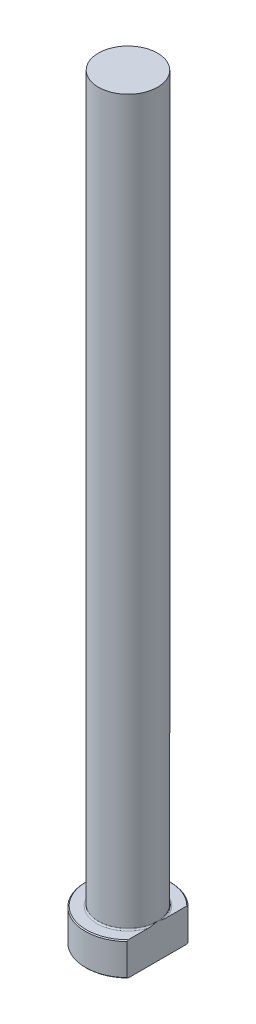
ISO-10303-21;
HEADER;
FILE_DESCRIPTION(('STEP AP214'),'2;1');
FILE_NAME('part.step','',(''),(''),'','','');
FILE_SCHEMA(('AUTOMOTIVE_DESIGN { 1 0 10303 214 1 1 1 1 }'));
ENDSEC;
DATA;
#1=APPLICATION_CONTEXT('core data for automotive mechanical design processes');
#2=APPLICATION_PROTOCOL_DEFINITION('international standard','automotive_design',2000,#1);
#3=PRODUCT_CONTEXT('',#1,'mechanical');
#4=PRODUCT('Part','Part','',(#3));
#5=PRODUCT_RELATED_PRODUCT_CATEGORY('part','',(#4));
#6=PRODUCT_DEFINITION_FORMATION('','',#4);
#7=PRODUCT_DEFINITION_CONTEXT('part definition',#1,'design');
#8=PRODUCT_DEFINITION('design','',#6,#7);
#9=PRODUCT_DEFINITION_SHAPE('','',#8);
#10=(LENGTH_UNIT() NAMED_UNIT(*) SI_UNIT(.MILLI.,.METRE.));
#11=(NAMED_UNIT(*) PLANE_ANGLE_UNIT() SI_UNIT($,.RADIAN.));
#12=(NAMED_UNIT(*) SI_UNIT($,.STERADIAN.) SOLID_ANGLE_UNIT());
#13=UNCERTAINTY_MEASURE_WITH_UNIT(LENGTH_MEASURE(1.E-05),#10,'distance_accuracy_value','');
#14=(GEOMETRIC_REPRESENTATION_CONTEXT(3) GLOBAL_UNCERTAINTY_ASSIGNED_CONTEXT((#13)) GLOBAL_UNIT_ASSIGNED_CONTEXT((#10,
#11,#12)) REPRESENTATION_CONTEXT('',''));
#15=CARTESIAN_POINT('',(0.,0.,0.));
#16=DIRECTION('',(0.,0.,1.));
#17=DIRECTION('',(1.,0.,0.));
#18=AXIS2_PLACEMENT_3D('',#15,#16,#17);
#19=CARTESIAN_POINT('',(0.,0.,0.));
#20=DIRECTION('',(0.,-1.,0.));
#21=DIRECTION('',(0.,0.,-1.));
#22=AXIS2_PLACEMENT_3D('',#19,#20,#21);
#23=PLANE('',#22);
#24=CARTESIAN_POINT('',(0.,0.,0.));
#25=DIRECTION('',(0.,-1.,0.));
#26=DIRECTION('',(0.,0.,-1.));
#27=AXIS2_PLACEMENT_3D('',#24,#25,#26);
#28=CIRCLE('',#27,8.79999999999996);
#29=CARTESIAN_POINT('',(6.24999999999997,0.,6.1949576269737));
#30=VERTEX_POINT('',#29);
#31=CARTESIAN_POINT('',(6.24999999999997,0.,-6.1949576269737));
#32=VERTEX_POINT('',#31);
#33=EDGE_CURVE('E98',#30,#32,#28,.T.);
#34=ORIENTED_EDGE('',*,*,#33,.T.);
#35=DIRECTION('',(0.,0.,1.));
#36=VECTOR('',#35,1.);
#37=CARTESIAN_POINT('',(6.24999999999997,0.,-6.47591692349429));
#38=LINE('',#37,#36);
#39=EDGE_CURVE('E83',#32,#30,#38,.T.);
#40=ORIENTED_EDGE('',*,*,#39,.T.);
#41=EDGE_LOOP('',(#34,#40));
#42=FACE_BOUND('',#41,.T.);
#43=ADVANCED_FACE('F32',(#42),#23,.T.);
#44=CARTESIAN_POINT('',(0.,259.958771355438,0.));
#45=DIRECTION('',(0.,1.,0.));
#46=DIRECTION('',(0.,0.,1.));
#47=AXIS2_PLACEMENT_3D('',#44,#45,#46);
#48=CYLINDRICAL_SURFACE('',#47,8.99999999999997);
#49=CARTESIAN_POINT('',(0.,6.80000000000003,0.));
#50=DIRECTION('',(0.,1.,0.));
#51=DIRECTION('',(0.,0.,1.));
#52=AXIS2_PLACEMENT_3D('',#49,#50,#51);
#53=CIRCLE('',#52,8.99999999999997);
#54=CARTESIAN_POINT('',(6.24999999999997,6.80000000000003,6.47591692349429));
#55=VERTEX_POINT('',#54);
#56=CARTESIAN_POINT('',(6.24999999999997,6.80000000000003,-6.47591692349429));
#57=VERTEX_POINT('',#56);
#58=EDGE_CURVE('E104',#55,#57,#53,.F.);
#59=ORIENTED_EDGE('',*,*,#58,.T.);
#60=DIRECTION('',(0.,-1.,0.));
#61=VECTOR('',#60,1.);
#62=CARTESIAN_POINT('',(6.24999999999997,160.,-6.47591692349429));
#63=LINE('',#62,#61);
#64=CARTESIAN_POINT('',(6.24999999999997,0.199999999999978,-6.47591692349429));
#65=VERTEX_POINT('',#64);
#66=EDGE_CURVE('E183',#57,#65,#63,.T.);
#67=ORIENTED_EDGE('',*,*,#66,.T.);
#68=CARTESIAN_POINT('',(0.,0.199999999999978,0.));
#69=DIRECTION('',(0.,-1.,0.));
#70=DIRECTION('',(0.,0.,-1.));
#71=AXIS2_PLACEMENT_3D('',#68,#69,#70);
#72=CIRCLE('',#71,8.99999999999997);
#73=CARTESIAN_POINT('',(6.24999999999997,0.199999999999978,6.47591692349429));
#74=VERTEX_POINT('',#73);
#75=EDGE_CURVE('E100',#65,#74,#72,.F.);
#76=ORIENTED_EDGE('',*,*,#75,.T.);
#77=DIRECTION('',(0.,-1.,0.));
#78=VECTOR('',#77,1.);
#79=CARTESIAN_POINT('',(6.24999999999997,160.,6.47591692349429));
#80=LINE('',#79,#78);
#81=EDGE_CURVE('E93',#55,#74,#80,.T.);
#82=ORIENTED_EDGE('',*,*,#81,.F.);
#83=EDGE_LOOP('',(#59,#67,#76,#82));
#84=FACE_BOUND('',#83,.T.);
#85=ADVANCED_FACE('F158',(#84),#48,.T.);
#86=CARTESIAN_POINT('',(-8.99999999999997,7.,0.));
#87=DIRECTION('',(0.,1.,0.));
#88=DIRECTION('',(0.,0.,1.));
#89=AXIS2_PLACEMENT_3D('',#86,#87,#88);
#90=PLANE('',#89);
#91=CARTESIAN_POINT('',(0.,7.,0.));
#92=DIRECTION('',(0.,1.,0.));
#93=DIRECTION('',(0.,0.,1.));
#94=AXIS2_PLACEMENT_3D('',#91,#92,#93);
#95=CIRCLE('',#94,8.79999999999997);
#96=CARTESIAN_POINT('',(6.24999999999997,7.,-6.19495762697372));
#97=VERTEX_POINT('',#96);
#98=CARTESIAN_POINT('',(6.24999999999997,7.,6.19495762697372));
#99=VERTEX_POINT('',#98);
#100=EDGE_CURVE('E178',#97,#99,#95,.T.);
#101=ORIENTED_EDGE('',*,*,#100,.T.);
#102=DIRECTION('',(0.,0.,-1.));
#103=VECTOR('',#102,1.);
#104=CARTESIAN_POINT('',(6.24999999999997,7.,0.));
#105=LINE('',#104,#103);
#106=CARTESIAN_POINT('',(6.24999999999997,6.99999999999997,1.95959179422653));
#107=VERTEX_POINT('',#106);
#108=EDGE_CURVE('E57',#99,#107,#105,.T.);
#109=ORIENTED_EDGE('',*,*,#108,.T.);
#110=CARTESIAN_POINT('',(0.,7.,0.));
#111=DIRECTION('',(0.,1.,0.));
#112=DIRECTION('',(0.,0.,1.));
#113=AXIS2_PLACEMENT_3D('',#110,#111,#112);
#114=CIRCLE('',#113,6.54999999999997);
#115=CARTESIAN_POINT('',(6.24999999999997,6.99999999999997,-1.95959179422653));
#116=VERTEX_POINT('',#115);
#117=EDGE_CURVE('E107',#107,#116,#114,.F.);
#118=ORIENTED_EDGE('',*,*,#117,.T.);
#119=EDGE_CURVE('E136',#116,#97,#105,.T.);
#120=ORIENTED_EDGE('',*,*,#119,.T.);
#121=EDGE_LOOP('',(#101,#109,#118,#120));
#122=FACE_BOUND('',#121,.T.);
#123=ADVANCED_FACE('F147',(#122),#90,.T.);
#124=CARTESIAN_POINT('',(0.,7.00000000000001,0.));
#125=DIRECTION('',(0.,-1.,0.));
#126=DIRECTION('',(0.,0.,-1.));
#127=AXIS2_PLACEMENT_3D('',#124,#125,#126);
#128=CONICAL_SURFACE('',#127,8.79999999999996,0.785398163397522);
#129=ORIENTED_EDGE('',*,*,#58,.F.);
#130=CARTESIAN_POINT('',(6.24999999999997,0.241333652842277,14.2481436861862));
#131=CARTESIAN_POINT('',(6.24999999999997,0.433510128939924,14.0382871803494));
#132=CARTESIAN_POINT('',(6.24999999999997,0.625318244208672,13.8280934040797));
#133=CARTESIAN_POINT('',(6.24999999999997,1.00808847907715,13.406933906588));
#134=CARTESIAN_POINT('',(6.24999999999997,1.1990505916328,13.195968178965));
#135=CARTESIAN_POINT('',(6.24999999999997,1.77058893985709,12.5616726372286));
#136=CARTESIAN_POINT('',(6.24999999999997,2.14972657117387,12.1370432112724));
#137=CARTESIAN_POINT('',(6.24999999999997,2.90544742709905,11.2804244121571));
#138=CARTESIAN_POINT('',(6.24999999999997,3.28199640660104,10.8484047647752));
#139=CARTESIAN_POINT('',(6.24999999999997,4.0280031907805,9.97835973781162));
#140=CARTESIAN_POINT('',(6.24999999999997,4.3974618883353,9.54033512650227));
#141=CARTESIAN_POINT('',(6.24999999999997,5.06619556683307,8.72902037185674));
#142=CARTESIAN_POINT('',(6.24999999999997,5.36698522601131,8.35698524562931));
#143=CARTESIAN_POINT('',(6.24999999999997,5.81091107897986,7.79312105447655));
#144=CARTESIAN_POINT('',(6.24999999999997,5.95769918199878,7.60416746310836));
#145=CARTESIAN_POINT('',(6.24999999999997,6.2483499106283,7.22402635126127));
#146=CARTESIAN_POINT('',(6.24999999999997,6.39221261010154,7.03283888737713));
#147=CARTESIAN_POINT('',(6.24999999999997,6.67624882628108,6.64809388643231));
#148=CARTESIAN_POINT('',(6.24999999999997,6.81642658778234,6.45453948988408));
#149=CARTESIAN_POINT('',(6.24999999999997,7.09250069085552,6.06440831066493));
#150=CARTESIAN_POINT('',(6.24999999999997,7.22839726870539,5.86783169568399));
#151=CARTESIAN_POINT('',(6.24999999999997,7.4948722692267,5.47121725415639));
#152=CARTESIAN_POINT('',(6.24999999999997,7.62545297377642,5.27118096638));
#153=CARTESIAN_POINT('',(6.24999999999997,7.88005759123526,4.86699392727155));
#154=CARTESIAN_POINT('',(6.24999999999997,8.00408234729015,4.66284370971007));
#155=CARTESIAN_POINT('',(6.24999999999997,8.24192682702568,4.25315549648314));
#156=CARTESIAN_POINT('',(6.24999999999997,8.35588135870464,4.04769623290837));
#157=CARTESIAN_POINT('',(6.24999999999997,8.57376120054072,3.63145654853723));
#158=CARTESIAN_POINT('',(6.24999999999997,8.67768550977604,3.42067559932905));
#159=CARTESIAN_POINT('',(6.24999999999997,8.87268822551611,2.99352725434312));
#160=CARTESIAN_POINT('',(6.24999999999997,8.96378316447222,2.77716748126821));
#161=CARTESIAN_POINT('',(6.24999999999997,9.12997532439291,2.33835397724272));
#162=CARTESIAN_POINT('',(6.24999999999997,9.20507709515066,2.11590199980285));
#163=CARTESIAN_POINT('',(6.24999999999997,9.32245998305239,1.71047588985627));
#164=CARTESIAN_POINT('',(6.24999999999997,9.36830307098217,1.52853906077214));
#165=CARTESIAN_POINT('',(6.24999999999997,9.44550018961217,1.16159607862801));
#166=CARTESIAN_POINT('',(6.24999999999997,9.47685624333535,0.976590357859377));
#167=CARTESIAN_POINT('',(6.24999999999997,9.52348341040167,0.605004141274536));
#168=CARTESIAN_POINT('',(6.24999999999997,9.53879458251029,0.418428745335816));
#169=CARTESIAN_POINT('',(6.24999999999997,9.55263073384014,0.044648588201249));
#170=CARTESIAN_POINT('',(6.24999999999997,9.5511559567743,-0.142556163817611));
#171=CARTESIAN_POINT('',(6.24999999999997,9.53151010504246,-0.515964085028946));
#172=CARTESIAN_POINT('',(6.24999999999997,9.51334871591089,-0.702167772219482));
#173=CARTESIAN_POINT('',(6.24999999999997,9.46132296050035,-1.07235055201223));
#174=CARTESIAN_POINT('',(6.24999999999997,9.42745724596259,-1.25632945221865));
#175=CARTESIAN_POINT('',(6.24999999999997,9.34551825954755,-1.62161387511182));
#176=CARTESIAN_POINT('',(6.24999999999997,9.29740414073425,-1.80291011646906));
#177=CARTESIAN_POINT('',(6.24999999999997,9.18891949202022,-2.1617472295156));
#178=CARTESIAN_POINT('',(6.24999999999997,9.12854919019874,-2.33928817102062));
#179=CARTESIAN_POINT('',(6.24999999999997,8.98038960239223,-2.736196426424));
#180=CARTESIAN_POINT('',(6.24999999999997,8.8895537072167,-2.95442044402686));
#181=CARTESIAN_POINT('',(6.24999999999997,8.69480317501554,-3.38500003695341));
#182=CARTESIAN_POINT('',(6.24999999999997,8.59088203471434,-3.59735262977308));
#183=CARTESIAN_POINT('',(6.24999999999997,8.37253952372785,-4.01706977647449));
#184=CARTESIAN_POINT('',(6.24999999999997,8.2580982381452,-4.22442389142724));
#185=CARTESIAN_POINT('',(6.24999999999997,8.02107167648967,-4.63434772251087));
#186=CARTESIAN_POINT('',(6.24999999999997,7.89848770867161,-4.83691820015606));
#187=CARTESIAN_POINT('',(6.24999999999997,7.64548625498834,-5.2400840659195));
#188=CARTESIAN_POINT('',(6.24999999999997,7.51499955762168,-5.44063581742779));
#189=CARTESIAN_POINT('',(6.24999999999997,7.24868510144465,-5.83817237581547));
#190=CARTESIAN_POINT('',(6.24999999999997,7.11285688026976,-6.03515687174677));
#191=CARTESIAN_POINT('',(6.24999999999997,6.83683288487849,-6.42612120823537));
#192=CARTESIAN_POINT('',(6.24999999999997,6.69663581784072,-6.62010013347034));
#193=CARTESIAN_POINT('',(6.24999999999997,6.41268260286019,-7.00543858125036));
#194=CARTESIAN_POINT('',(6.24999999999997,6.26892633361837,-7.19679801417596));
#195=CARTESIAN_POINT('',(6.24999999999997,5.89056224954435,-7.69242940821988));
#196=CARTESIAN_POINT('',(6.24999999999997,5.65363599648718,-7.99493062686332));
#197=CARTESIAN_POINT('',(6.24999999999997,5.17412949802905,-8.59529922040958));
#198=CARTESIAN_POINT('',(6.24999999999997,4.93155037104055,-8.89316749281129));
#199=CARTESIAN_POINT('',(6.24999999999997,4.44181409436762,-9.48544309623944));
#200=CARTESIAN_POINT('',(6.24999999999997,4.19465400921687,-9.77984799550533));
#201=CARTESIAN_POINT('',(6.24999999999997,3.69683790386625,-10.3657062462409));
#202=CARTESIAN_POINT('',(6.24999999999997,3.44618171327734,-10.6571594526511));
#203=CARTESIAN_POINT('',(6.24999999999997,2.95199448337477,-11.2262122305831));
#204=CARTESIAN_POINT('',(6.24999999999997,2.70857128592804,-11.5039055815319));
#205=CARTESIAN_POINT('',(6.24999999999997,2.21961081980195,-12.0574158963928));
#206=CARTESIAN_POINT('',(6.24999999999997,1.97407358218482,-12.3332328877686));
#207=CARTESIAN_POINT('',(6.24999999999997,1.48150971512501,-12.8829958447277));
#208=CARTESIAN_POINT('',(6.24999999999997,1.23448497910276,-13.1569435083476));
#209=CARTESIAN_POINT('',(6.24999999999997,0.738953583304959,-13.703494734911));
#210=CARTESIAN_POINT('',(6.24999999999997,0.490446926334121,-13.9760983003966));
#211=CARTESIAN_POINT('',(6.24999999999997,0.241333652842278,-14.2481436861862));
#212=B_SPLINE_CURVE_WITH_KNOTS('',3,(#130,#131,#132,#133,#134,#135,#136,#137,#138,#139,#140,
#141,#142,#143,#144,#145,#146,#147,#148,#149,#150,#151,#152,#153,#154,#155,#156,#157,#158,#159,
#160,#161,#162,#163,#164,#165,#166,#167,#168,#169,#170,#171,#172,#173,#174,#175,#176,#177,#178,
#179,#180,#181,#182,#183,#184,#185,#186,#187,#188,#189,#190,#191,#192,#193,#194,#195,#196,#197,
#198,#199,#200,#201,#202,#203,#204,#205,#206,#207,#208,#209,#210,#211),.UNSPECIFIED.,.F.,.F.,(4,
2,2,2,2,2,2,2,2,2,2,2,2,2,2,2,2,2,2,2,2,2,2,2,2,2,2,2,2,2,2,2,2,2,2,2,2,2,2,2,4),(0.,
0.853664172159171,1.70733543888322,3.41508002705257,5.13429133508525,6.85328470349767,
8.28840776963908,9.00619588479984,9.72396585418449,10.4408691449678,11.1577328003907,
11.8742854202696,12.5907456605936,13.2953619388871,14.0000484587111,14.7038184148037,
15.4073878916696,15.9697505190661,16.5320345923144,17.0929114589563,17.6537801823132,
18.2143235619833,18.7749150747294,19.3371294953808,19.8993334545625,20.6078926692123,
21.3168054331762,22.027088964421,22.7372586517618,23.4549493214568,24.1727022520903,
24.8906696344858,25.6086615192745,26.7612833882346,27.9136791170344,29.0668407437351,
30.2200587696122,31.3278889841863,32.4357029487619,33.5423213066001,34.6489375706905),.UNSPECIFIED.);
#213=EDGE_CURVE('E135',#55,#99,#212,.T.);
#214=ORIENTED_EDGE('',*,*,#213,.T.);
#215=ORIENTED_EDGE('',*,*,#100,.F.);
#216=EDGE_CURVE('E127',#97,#57,#212,.T.);
#217=ORIENTED_EDGE('',*,*,#216,.T.);
#218=EDGE_LOOP('',(#129,#214,#215,#217));
#219=FACE_BOUND('',#218,.T.);
#220=ADVANCED_FACE('F143',(#219),#128,.T.);
#221=CARTESIAN_POINT('',(0.,0.199999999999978,0.));
#222=DIRECTION('',(0.,1.,0.));
#223=DIRECTION('',(0.,0.,1.));
#224=AXIS2_PLACEMENT_3D('',#221,#222,#223);
#225=CONICAL_SURFACE('',#224,8.99999999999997,0.785398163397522);
#226=ORIENTED_EDGE('',*,*,#75,.F.);
#227=CARTESIAN_POINT('',(6.24999999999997,6.75866634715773,-14.2481436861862));
#228=CARTESIAN_POINT('',(6.24999999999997,6.56648987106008,-14.0382871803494));
#229=CARTESIAN_POINT('',(6.24999999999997,6.37468175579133,-13.8280934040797));
#230=CARTESIAN_POINT('',(6.24999999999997,5.99191152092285,-13.406933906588));
#231=CARTESIAN_POINT('',(6.24999999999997,5.8009494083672,-13.195968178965));
#232=CARTESIAN_POINT('',(6.24999999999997,5.22941106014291,-12.5616726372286));
#233=CARTESIAN_POINT('',(6.24999999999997,4.85027342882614,-12.1370432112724));
#234=CARTESIAN_POINT('',(6.24999999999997,4.09455257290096,-11.2804244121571));
#235=CARTESIAN_POINT('',(6.24999999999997,3.71800359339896,-10.8484047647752));
#236=CARTESIAN_POINT('',(6.24999999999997,2.97199680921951,-9.97835973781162));
#237=CARTESIAN_POINT('',(6.24999999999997,2.60253811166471,-9.54033512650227));
#238=CARTESIAN_POINT('',(6.24999999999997,1.93380443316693,-8.72902037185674));
#239=CARTESIAN_POINT('',(6.24999999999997,1.6330147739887,-8.35698524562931));
#240=CARTESIAN_POINT('',(6.24999999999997,1.18908892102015,-7.79312105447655));
#241=CARTESIAN_POINT('',(6.24999999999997,1.04230081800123,-7.60416746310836));
#242=CARTESIAN_POINT('',(6.24999999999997,0.751650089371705,-7.22402635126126));
#243=CARTESIAN_POINT('',(6.24999999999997,0.607787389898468,-7.03283888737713));
#244=CARTESIAN_POINT('',(6.24999999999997,0.323751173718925,-6.64809388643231));
#245=CARTESIAN_POINT('',(6.24999999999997,0.183573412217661,-6.45453948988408));
#246=CARTESIAN_POINT('',(6.24999999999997,-0.0925006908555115,-6.06440831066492));
#247=CARTESIAN_POINT('',(6.24999999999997,-0.228397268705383,-5.86783169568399));
#248=CARTESIAN_POINT('',(6.24999999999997,-0.494872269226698,-5.47121725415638));
#249=CARTESIAN_POINT('',(6.24999999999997,-0.625452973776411,-5.27118096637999));
#250=CARTESIAN_POINT('',(6.24999999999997,-0.880057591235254,-4.86699392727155));
#251=CARTESIAN_POINT('',(6.24999999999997,-1.00408234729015,-4.66284370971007));
#252=CARTESIAN_POINT('',(6.24999999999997,-1.24192682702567,-4.25315549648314));
#253=CARTESIAN_POINT('',(6.24999999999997,-1.35588135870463,-4.04769623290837));
#254=CARTESIAN_POINT('',(6.24999999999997,-1.57376120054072,-3.63145654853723));
#255=CARTESIAN_POINT('',(6.24999999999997,-1.67768550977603,-3.42067559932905));
#256=CARTESIAN_POINT('',(6.24999999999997,-1.8726882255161,-2.99352725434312));
#257=CARTESIAN_POINT('',(6.24999999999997,-1.96378316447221,-2.77716748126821));
#258=CARTESIAN_POINT('',(6.24999999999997,-2.1299753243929,-2.33835397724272));
#259=CARTESIAN_POINT('',(6.24999999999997,-2.20507709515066,-2.11590199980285));
#260=CARTESIAN_POINT('',(6.24999999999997,-2.32245998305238,-1.71047588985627));
#261=CARTESIAN_POINT('',(6.24999999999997,-2.36830307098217,-1.52853906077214));
#262=CARTESIAN_POINT('',(6.24999999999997,-2.44550018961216,-1.16159607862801));
#263=CARTESIAN_POINT('',(6.24999999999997,-2.47685624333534,-0.976590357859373));
#264=CARTESIAN_POINT('',(6.24999999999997,-2.52348341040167,-0.605004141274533));
#265=CARTESIAN_POINT('',(6.24999999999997,-2.53879458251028,-0.418428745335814));
#266=CARTESIAN_POINT('',(6.24999999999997,-2.55263073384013,-0.0446485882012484));
#267=CARTESIAN_POINT('',(6.24999999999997,-2.5511559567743,0.142556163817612));
#268=CARTESIAN_POINT('',(6.24999999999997,-2.53151010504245,0.515964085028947));
#269=CARTESIAN_POINT('',(6.24999999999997,-2.51334871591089,0.702167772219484));
#270=CARTESIAN_POINT('',(6.24999999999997,-2.46132296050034,1.07235055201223));
#271=CARTESIAN_POINT('',(6.24999999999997,-2.42745724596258,1.25632945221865));
#272=CARTESIAN_POINT('',(6.24999999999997,-2.34551825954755,1.62161387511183));
#273=CARTESIAN_POINT('',(6.24999999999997,-2.29740414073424,1.80291011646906));
#274=CARTESIAN_POINT('',(6.24999999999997,-2.18891949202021,2.16174722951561));
#275=CARTESIAN_POINT('',(6.24999999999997,-2.12854919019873,2.33928817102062));
#276=CARTESIAN_POINT('',(6.24999999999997,-1.98038960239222,2.736196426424));
#277=CARTESIAN_POINT('',(6.24999999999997,-1.8895537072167,2.95442044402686));
#278=CARTESIAN_POINT('',(6.24999999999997,-1.69480317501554,3.38500003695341));
#279=CARTESIAN_POINT('',(6.24999999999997,-1.59088203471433,3.59735262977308));
#280=CARTESIAN_POINT('',(6.24999999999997,-1.37253952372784,4.01706977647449));
#281=CARTESIAN_POINT('',(6.24999999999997,-1.25809823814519,4.22442389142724));
#282=CARTESIAN_POINT('',(6.24999999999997,-1.02107167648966,4.63434772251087));
#283=CARTESIAN_POINT('',(6.24999999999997,-0.898487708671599,4.83691820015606));
#284=CARTESIAN_POINT('',(6.24999999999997,-0.645486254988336,5.2400840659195));
#285=CARTESIAN_POINT('',(6.24999999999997,-0.514999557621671,5.44063581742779));
#286=CARTESIAN_POINT('',(6.24999999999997,-0.24868510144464,5.83817237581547));
#287=CARTESIAN_POINT('',(6.24999999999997,-0.112856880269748,6.03515687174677));
#288=CARTESIAN_POINT('',(6.24999999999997,0.16316711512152,6.42612120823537));
#289=CARTESIAN_POINT('',(6.24999999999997,0.303364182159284,6.62010013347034));
#290=CARTESIAN_POINT('',(6.24999999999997,0.587317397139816,7.00543858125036));
#291=CARTESIAN_POINT('',(6.24999999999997,0.73107366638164,7.19679801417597));
#292=CARTESIAN_POINT('',(6.24999999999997,1.10943775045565,7.69242940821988));
#293=CARTESIAN_POINT('',(6.24999999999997,1.34636400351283,7.99493062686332));
#294=CARTESIAN_POINT('',(6.24999999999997,1.82587050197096,8.59529922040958));
#295=CARTESIAN_POINT('',(6.24999999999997,2.06844962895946,8.89316749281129));
#296=CARTESIAN_POINT('',(6.24999999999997,2.55818590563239,9.48544309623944));
#297=CARTESIAN_POINT('',(6.24999999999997,2.80534599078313,9.77984799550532));
#298=CARTESIAN_POINT('',(6.24999999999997,3.30316209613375,10.3657062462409));
#299=CARTESIAN_POINT('',(6.24999999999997,3.55381828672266,10.6571594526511));
#300=CARTESIAN_POINT('',(6.24999999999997,4.04800551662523,11.2262122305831));
#301=CARTESIAN_POINT('',(6.24999999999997,4.29142871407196,11.5039055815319));
#302=CARTESIAN_POINT('',(6.24999999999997,4.78038918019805,12.0574158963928));
#303=CARTESIAN_POINT('',(6.24999999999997,5.02592641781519,12.3332328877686));
#304=CARTESIAN_POINT('',(6.24999999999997,5.51849028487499,12.8829958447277));
#305=CARTESIAN_POINT('',(6.24999999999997,5.76551502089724,13.1569435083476));
#306=CARTESIAN_POINT('',(6.24999999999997,6.26104641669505,13.703494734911));
#307=CARTESIAN_POINT('',(6.24999999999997,6.50955307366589,13.9760983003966));
#308=CARTESIAN_POINT('',(6.24999999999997,6.75866634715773,14.2481436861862));
#309=B_SPLINE_CURVE_WITH_KNOTS('',3,(#227,#228,#229,#230,#231,#232,#233,#234,#235,#236,#237,
#238,#239,#240,#241,#242,#243,#244,#245,#246,#247,#248,#249,#250,#251,#252,#253,#254,#255,#256,
#257,#258,#259,#260,#261,#262,#263,#264,#265,#266,#267,#268,#269,#270,#271,#272,#273,#274,#275,
#276,#277,#278,#279,#280,#281,#282,#283,#284,#285,#286,#287,#288,#289,#290,#291,#292,#293,#294,
#295,#296,#297,#298,#299,#300,#301,#302,#303,#304,#305,#306,#307,#308),.UNSPECIFIED.,.F.,.F.,(4,
2,2,2,2,2,2,2,2,2,2,2,2,2,2,2,2,2,2,2,2,2,2,2,2,2,2,2,2,2,2,2,2,2,2,2,2,2,2,2,4),(0.,
0.853664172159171,1.70733543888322,3.41508002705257,5.13429133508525,6.85328470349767,
8.28840776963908,9.00619588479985,9.72396585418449,10.4408691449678,11.1577328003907,
11.8742854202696,12.5907456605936,13.2953619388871,14.0000484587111,14.7038184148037,
15.4073878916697,15.9697505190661,16.5320345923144,17.0929114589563,17.6537801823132,
18.2143235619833,18.7749150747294,19.3371294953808,19.8993334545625,20.6078926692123,
21.3168054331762,22.027088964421,22.7372586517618,23.4549493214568,24.1727022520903,
24.8906696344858,25.6086615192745,26.7612833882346,27.9136791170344,29.0668407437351,
30.2200587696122,31.3278889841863,32.4357029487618,33.5423213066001,34.6489375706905),.UNSPECIFIED.);
#310=EDGE_CURVE('E86',#65,#32,#309,.T.);
#311=ORIENTED_EDGE('',*,*,#310,.T.);
#312=ORIENTED_EDGE('',*,*,#33,.F.);
#313=EDGE_CURVE('E89',#30,#74,#309,.T.);
#314=ORIENTED_EDGE('',*,*,#313,.T.);
#315=EDGE_LOOP('',(#226,#311,#312,#314));
#316=FACE_BOUND('',#315,.T.);
#317=ADVANCED_FACE('F97',(#316),#225,.T.);
#318=CARTESIAN_POINT('',(0.,7.29999999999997,0.));
#319=DIRECTION('',(0.,1.,0.));
#320=DIRECTION('',(0.,0.,1.));
#321=AXIS2_PLACEMENT_3D('',#318,#319,#320);
#322=TOROIDAL_SURFACE('',#321,6.54999999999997,0.3);
#323=CARTESIAN_POINT('',(6.24999999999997,7.29999999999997,0.));
#324=CARTESIAN_POINT('',(6.24999999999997,7.30000062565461,1.07935811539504E-10));
#325=CARTESIAN_POINT('',(6.24999999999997,7.30000125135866,-2.93503388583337E-07));
#326=CARTESIAN_POINT('',(6.24999999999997,7.300002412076,-1.07409020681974E-06));
#327=CARTESIAN_POINT('',(6.24999999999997,7.30000292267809,-1.58214987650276E-06));
#328=CARTESIAN_POINT('',(6.24999999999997,7.30000400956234,-2.8081901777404E-06));
#329=CARTESIAN_POINT('',(6.24999999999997,7.30000456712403,-3.54604295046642E-06));
#330=CARTESIAN_POINT('',(6.24999999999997,7.30000554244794,-5.05412397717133E-06));
#331=CARTESIAN_POINT('',(6.24999999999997,7.30000596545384,-5.82130991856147E-06));
#332=CARTESIAN_POINT('',(6.24999999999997,7.30000759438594,-8.87270548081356E-06));
#333=CARTESIAN_POINT('',(6.24999999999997,7.30000872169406,-1.1203275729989E-05));
#334=CARTESIAN_POINT('',(6.24999999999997,7.30001051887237,-1.57552363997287E-05));
#335=CARTESIAN_POINT('',(6.24999999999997,7.30001122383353,-1.79632548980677E-05));
#336=CARTESIAN_POINT('',(6.24999999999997,7.30001427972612,-2.752581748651E-05));
#337=CARTESIAN_POINT('',(6.24999999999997,7.30001663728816,-3.48805238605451E-05));
#338=CARTESIAN_POINT('',(6.24999999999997,7.30002001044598,-4.8619148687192E-05));
#339=CARTESIAN_POINT('',(6.24999999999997,7.30002118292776,-5.49639235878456E-05));
#340=CARTESIAN_POINT('',(6.24999999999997,7.30002986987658,-0.000102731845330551));
#341=CARTESIAN_POINT('',(6.24999999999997,7.30003662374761,-0.000144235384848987));
#342=CARTESIAN_POINT('',(6.24999999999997,7.30006617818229,-0.000309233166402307));
#343=CARTESIAN_POINT('',(6.24999999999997,7.3000942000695,-0.000431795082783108));
#344=CARTESIAN_POINT('',(6.24999999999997,7.30020410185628,-0.000919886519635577));
#345=CARTESIAN_POINT('',(6.24999999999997,7.3002827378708,-0.00128589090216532));
#346=CARTESIAN_POINT('',(6.24999999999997,7.30059929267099,-0.00274922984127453));
#347=CARTESIAN_POINT('',(6.24999999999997,7.30084138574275,-0.00384592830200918));
#348=CARTESIAN_POINT('',(6.24999999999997,7.30185366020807,-0.00844291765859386));
#349=CARTESIAN_POINT('',(6.24999999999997,7.30261854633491,-0.0119440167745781));
#350=CARTESIAN_POINT('',(6.24999999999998,7.30934535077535,-0.0427197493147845));
#351=CARTESIAN_POINT('',(6.24999999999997,7.31532845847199,-0.0699912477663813));
#352=CARTESIAN_POINT('',(6.24999999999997,7.32701994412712,-0.1234289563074));
#353=CARTESIAN_POINT('',(6.24999999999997,7.33272958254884,-0.14959492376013));
#354=CARTESIAN_POINT('',(6.24999999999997,7.34485779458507,-0.205323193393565));
#355=CARTESIAN_POINT('',(6.24999999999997,7.35127239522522,-0.23488638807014));
#356=CARTESIAN_POINT('',(6.24999999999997,7.36411066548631,-0.294356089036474));
#357=CARTESIAN_POINT('',(6.24999999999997,7.37053363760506,-0.324262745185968));
#358=CARTESIAN_POINT('',(6.24999999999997,7.38584616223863,-0.396051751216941));
#359=CARTESIAN_POINT('',(6.24999999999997,7.39469543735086,-0.437942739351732));
#360=CARTESIAN_POINT('',(6.24999999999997,7.41192932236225,-0.520630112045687));
#361=CARTESIAN_POINT('',(6.24999999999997,7.42032002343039,-0.561425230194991));
#362=CARTESIAN_POINT('',(6.24999999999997,7.44742205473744,-0.69545636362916));
#363=CARTESIAN_POINT('',(6.24999999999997,7.4655604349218,-0.788810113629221));
#364=CARTESIAN_POINT('',(6.24999999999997,7.49982037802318,-0.976827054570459));
#365=CARTESIAN_POINT('',(6.24999999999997,7.51592073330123,-1.07149417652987));
#366=CARTESIAN_POINT('',(6.24999999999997,7.54633300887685,-1.27034734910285));
#367=CARTESIAN_POINT('',(6.24999999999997,7.56032934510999,-1.37458266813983));
#368=CARTESIAN_POINT('',(6.24999999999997,7.58288660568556,-1.58337219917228));
#369=CARTESIAN_POINT('',(6.24999999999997,7.59146383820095,-1.68792449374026));
#370=CARTESIAN_POINT('',(6.24999999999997,7.59839530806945,-1.84328437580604));
#371=CARTESIAN_POINT('',(6.24999999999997,7.59974160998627,-1.89395725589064));
#372=CARTESIAN_POINT('',(6.24999999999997,7.60019235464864,-1.99536854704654));
#373=CARTESIAN_POINT('',(6.24999999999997,7.59929473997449,-2.04610697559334));
#374=CARTESIAN_POINT('',(6.24999999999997,7.59472992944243,-2.14676570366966));
#375=CARTESIAN_POINT('',(6.24999999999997,7.5911010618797,-2.19668764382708));
#376=CARTESIAN_POINT('',(6.24999999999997,7.58034281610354,-2.29612823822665));
#377=CARTESIAN_POINT('',(6.24999999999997,7.57321785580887,-2.3456473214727));
#378=CARTESIAN_POINT('',(6.24999999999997,7.55883861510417,-2.41968621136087));
#379=CARTESIAN_POINT('',(6.24999999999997,7.55336305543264,-2.44455073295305));
#380=CARTESIAN_POINT('',(6.24999999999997,7.54088765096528,-2.49388968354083));
#381=CARTESIAN_POINT('',(6.24999999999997,7.53388865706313,-2.51836432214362));
#382=CARTESIAN_POINT('',(6.24999999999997,7.5180160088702,-2.56658659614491));
#383=CARTESIAN_POINT('',(6.24999999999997,7.50915079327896,-2.59033697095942));
#384=CARTESIAN_POINT('',(6.24999999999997,7.48896575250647,-2.63675110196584));
#385=CARTESIAN_POINT('',(6.24999999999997,7.47765263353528,-2.65941762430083));
#386=CARTESIAN_POINT('',(6.24999999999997,7.45696632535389,-2.69385500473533));
#387=CARTESIAN_POINT('',(6.24999999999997,7.4486983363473,-2.70628406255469));
#388=CARTESIAN_POINT('',(6.24999999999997,7.43069170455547,-2.73004308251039));
#389=CARTESIAN_POINT('',(6.24999999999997,7.42095514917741,-2.74137456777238));
#390=CARTESIAN_POINT('',(6.24999999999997,7.40313125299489,-2.75886410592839));
#391=CARTESIAN_POINT('',(6.24999999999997,7.39552792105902,-2.76551055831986));
#392=CARTESIAN_POINT('',(6.24999999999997,7.37942171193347,-2.77761940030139));
#393=CARTESIAN_POINT('',(6.24999999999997,7.37092027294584,-2.78308364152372));
#394=CARTESIAN_POINT('',(6.24999999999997,7.3552039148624,-2.79123019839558));
#395=CARTESIAN_POINT('',(6.24999999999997,7.34817405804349,-2.79426565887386));
#396=CARTESIAN_POINT('',(6.24999999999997,7.33371058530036,-2.79914227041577));
#397=CARTESIAN_POINT('',(6.24999999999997,7.32627746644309,-2.80098485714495));
#398=CARTESIAN_POINT('',(6.24999999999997,7.31114486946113,-2.80329865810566));
#399=CARTESIAN_POINT('',(6.24999999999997,7.30344395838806,-2.8037607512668));
#400=CARTESIAN_POINT('',(6.24999999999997,7.28809169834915,-2.80323167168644));
#401=CARTESIAN_POINT('',(6.24999999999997,7.28044035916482,-2.8022402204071));
#402=CARTESIAN_POINT('',(6.24999999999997,7.26612892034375,-2.79907216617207));
#403=CARTESIAN_POINT('',(6.24999999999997,7.25944213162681,-2.79701213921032));
#404=CARTESIAN_POINT('',(6.24999999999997,7.24643877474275,-2.79195274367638));
#405=CARTESIAN_POINT('',(6.24999999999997,7.24012234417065,-2.78895302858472));
#406=CARTESIAN_POINT('',(6.24999999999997,7.2241404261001,-2.78010234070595));
#407=CARTESIAN_POINT('',(6.24999999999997,7.21481747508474,-2.77363492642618));
#408=CARTESIAN_POINT('',(6.24999999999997,7.19727307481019,-2.75934472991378));
#409=CARTESIAN_POINT('',(6.24999999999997,7.18905534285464,-2.75151756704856));
#410=CARTESIAN_POINT('',(6.24999999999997,7.16746274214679,-2.72838666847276));
#411=CARTESIAN_POINT('',(6.24999999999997,7.15517318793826,-2.71208063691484));
#412=CARTESIAN_POINT('',(6.24999999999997,7.13297830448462,-2.67797126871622));
#413=CARTESIAN_POINT('',(6.24999999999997,7.12307686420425,-2.66016555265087));
#414=CARTESIAN_POINT('',(6.24999999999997,7.10185271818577,-2.61712561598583));
#415=CARTESIAN_POINT('',(6.24999999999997,7.09129494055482,-2.59151849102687));
#416=CARTESIAN_POINT('',(6.24999999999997,7.07260379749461,-2.53941658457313));
#417=CARTESIAN_POINT('',(6.24999999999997,7.06447530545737,-2.51292013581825));
#418=CARTESIAN_POINT('',(6.24999999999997,7.05002040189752,-2.45908915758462));
#419=CARTESIAN_POINT('',(6.24999999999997,7.04371803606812,-2.43174827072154));
#420=CARTESIAN_POINT('',(6.24999999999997,7.03267951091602,-2.37679196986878));
#421=CARTESIAN_POINT('',(6.24999999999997,7.0279416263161,-2.34917689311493));
#422=CARTESIAN_POINT('',(6.24999999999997,7.01732549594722,-2.27736486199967));
#423=CARTESIAN_POINT('',(6.24999999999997,7.01243082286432,-2.23302306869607));
#424=CARTESIAN_POINT('',(6.24999999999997,7.00516057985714,-2.1441265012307));
#425=CARTESIAN_POINT('',(6.24999999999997,7.00278642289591,-2.099571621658));
#426=CARTESIAN_POINT('',(6.24999999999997,6.99868217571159,-1.96551117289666));
#427=CARTESIAN_POINT('',(6.24999999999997,7.0000072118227,-1.87591316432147));
#428=CARTESIAN_POINT('',(6.24999999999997,7.0080292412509,-1.70248618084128));
#429=CARTESIAN_POINT('',(6.24999999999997,7.01439439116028,-1.61863796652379));
#430=CARTESIAN_POINT('',(6.24999999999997,7.03083822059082,-1.45127006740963));
#431=CARTESIAN_POINT('',(6.24999999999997,7.04091883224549,-1.3677505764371));
#432=CARTESIAN_POINT('',(6.24999999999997,7.06480380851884,-1.19431308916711));
#433=CARTESIAN_POINT('',(6.24999999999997,7.07884475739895,-1.10442856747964));
#434=CARTESIAN_POINT('',(6.24999999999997,7.10969415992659,-0.922729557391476));
#435=CARTESIAN_POINT('',(6.24999999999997,7.12656524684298,-0.830925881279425));
#436=CARTESIAN_POINT('',(6.24999999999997,7.15670076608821,-0.67515179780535));
#437=CARTESIAN_POINT('',(6.24999999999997,7.16952837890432,-0.611095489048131));
#438=CARTESIAN_POINT('',(6.24999999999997,7.19564112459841,-0.483838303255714));
#439=CARTESIAN_POINT('',(6.24999999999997,7.2089193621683,-0.420636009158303));
#440=CARTESIAN_POINT('',(6.24999999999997,7.23428285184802,-0.301644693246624));
#441=CARTESIAN_POINT('',(6.24999999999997,7.24632762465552,-0.245846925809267));
#442=CARTESIAN_POINT('',(6.24999999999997,7.27113004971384,-0.131848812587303));
#443=CARTESIAN_POINT('',(6.24999999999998,7.28389583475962,-0.0736501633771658));
#444=CARTESIAN_POINT('',(6.24999999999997,7.29738281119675,-0.0119373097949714));
#445=CARTESIAN_POINT('',(6.24999999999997,7.29814924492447,-0.00842953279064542));
#446=CARTESIAN_POINT('',(6.24999999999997,7.2991618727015,-0.00383105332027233));
#447=CARTESIAN_POINT('',(6.24999999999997,7.29940281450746,-0.00273954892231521));
#448=CARTESIAN_POINT('',(6.24999999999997,7.29971797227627,-0.00128266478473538));
#449=CARTESIAN_POINT('',(6.24999999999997,7.29979633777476,-0.000917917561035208));
#450=CARTESIAN_POINT('',(6.24999999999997,7.29990591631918,-0.000431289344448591));
#451=CARTESIAN_POINT('',(6.24999999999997,7.29993389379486,-0.000308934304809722));
#452=CARTESIAN_POINT('',(6.24999999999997,7.29996340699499,-0.00014417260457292));
#453=CARTESIAN_POINT('',(6.24999999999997,7.29997015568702,-0.000102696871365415));
#454=CARTESIAN_POINT('',(6.24999999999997,7.29997883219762,-5.49575231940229E-05));
#455=CARTESIAN_POINT('',(6.24999999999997,7.29998000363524,-4.86141750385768E-05));
#456=CARTESIAN_POINT('',(6.24999999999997,7.29998337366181,-3.48785875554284E-05));
#457=CARTESIAN_POINT('',(6.24999999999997,7.29998572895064,-2.75254181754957E-05));
#458=CARTESIAN_POINT('',(6.24999999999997,7.29998878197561,-1.79644811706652E-05));
#459=CARTESIAN_POINT('',(6.24999999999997,7.29998948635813,-1.57565691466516E-05));
#460=CARTESIAN_POINT('',(6.24999999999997,7.29999128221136,-1.12047374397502E-05));
#461=CARTESIAN_POINT('',(6.24999999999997,7.29999240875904,-8.87417477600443E-06));
#462=CARTESIAN_POINT('',(6.24999999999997,7.29999403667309,-5.82269238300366E-06));
#463=CARTESIAN_POINT('',(6.24999999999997,7.29999445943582,-5.05545097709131E-06));
#464=CARTESIAN_POINT('',(6.24999999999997,7.29999543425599,-3.54721514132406E-06));
#465=CARTESIAN_POINT('',(6.24999999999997,7.29999599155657,-2.80926073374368E-06));
#466=CARTESIAN_POINT('',(6.24999999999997,7.29999707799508,-1.58298694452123E-06));
#467=CARTESIAN_POINT('',(6.24999999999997,7.29999758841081,-1.07480544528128E-06));
#468=CARTESIAN_POINT('',(6.24999999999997,7.29999874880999,-2.93902319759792E-07));
#469=CARTESIAN_POINT('',(6.24999999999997,7.29999937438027,-1.07929784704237E-10));
#470=CARTESIAN_POINT('',(6.24999999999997,7.29999999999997,0.));
#471=B_SPLINE_CURVE_WITH_KNOTS('',3,(#323,#324,#325,#326,#327,#328,#329,#330,#331,#332,#333,
#334,#335,#336,#337,#338,#339,#340,#341,#342,#343,#344,#345,#346,#347,#348,#349,#350,#351,#352,
#353,#354,#355,#356,#357,#358,#359,#360,#361,#362,#363,#364,#365,#366,#367,#368,#369,#370,#371,
#372,#373,#374,#375,#376,#377,#378,#379,#380,#381,#382,#383,#384,#385,#386,#387,#388,#389,#390,
#391,#392,#393,#394,#395,#396,#397,#398,#399,#400,#401,#402,#403,#404,#405,#406,#407,#408,#409,
#410,#411,#412,#413,#414,#415,#416,#417,#418,#419,#420,#421,#422,#423,#424,#425,#426,#427,#428,
#429,#430,#431,#432,#433,#434,#435,#436,#437,#438,#439,#440,#441,#442,#443,#444,#445,#446,#447,
#448,#449,#450,#451,#452,#453,#454,#455,#456,#457,#458,#459,#460,#461,#462,#463,#464,#465,#466,
#467,#468,#469,#470),.UNSPECIFIED.,.T.,.F.,(4,2,2,2,2,2,2,2,2,2,2,2,2,2,2,2,2,2,2,2,2,2,2,2,2,2,
2,2,2,2,2,2,2,2,2,2,2,2,2,2,2,2,2,2,2,2,2,2,2,2,2,2,2,2,2,2,2,2,2,2,2,2,2,2,2,2,2,2,2,2,2,2,2,
4),(0.,1.91133621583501E-06,4.08629145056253E-06,6.84045192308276E-06,9.46814795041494E-06,
1.72102324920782E-05,2.41571318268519E-05,4.72958844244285E-05,6.66312210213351E-05,
0.000192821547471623,0.000569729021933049,0.0016930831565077,0.00506203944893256,
0.0158134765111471,0.0995718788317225,0.17991734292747,0.270670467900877,0.362436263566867,
0.49088205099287,0.615829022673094,0.901110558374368,1.18915184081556,1.50457944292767,
1.81905322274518,1.97108855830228,2.1232633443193,2.27334154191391,2.42323057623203,
2.49957602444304,2.5758789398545,2.65184396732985,2.72760346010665,2.77231358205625,
2.81696074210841,2.84717821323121,2.87734800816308,2.90023250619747,2.92308941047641,
2.94609700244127,2.96910900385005,2.99001820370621,3.01093512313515,3.04477802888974,
3.07873205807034,3.13964269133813,3.20065185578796,3.28355317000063,3.36661969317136,
3.45073488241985,3.53475699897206,3.66848651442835,3.80229095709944,4.07081278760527,
4.32299246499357,4.57530346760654,4.8481846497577,5.12818350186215,5.32416473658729,
5.51790851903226,5.68915816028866,5.86790059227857,5.87867257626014,5.88202557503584,
5.88314507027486,5.88352134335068,5.88364744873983,5.88366677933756,5.88368991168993,
5.88369685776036,5.88370459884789,5.88370722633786,5.8837099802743,5.88371215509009,
5.88371406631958),.UNSPECIFIED.);
#472=CARTESIAN_POINT('',(6.24999999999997,7.29999999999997,0.));
#473=VERTEX_POINT('',#472);
#474=EDGE_CURVE('E11',#116,#473,#471,.T.);
#475=ORIENTED_EDGE('',*,*,#474,.F.);
#476=ORIENTED_EDGE('',*,*,#117,.F.);
#477=CARTESIAN_POINT('',(6.24999999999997,7.29999999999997,0.));
#478=CARTESIAN_POINT('',(6.24999999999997,7.29999937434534,-1.07935744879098E-10));
#479=CARTESIAN_POINT('',(6.24999999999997,7.29999874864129,2.93503388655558E-07));
#480=CARTESIAN_POINT('',(6.24999999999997,7.29999758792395,1.07409020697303E-06));
#481=CARTESIAN_POINT('',(6.24999999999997,7.29999707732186,1.58214987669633E-06));
#482=CARTESIAN_POINT('',(6.24999999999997,7.2999959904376,2.80819017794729E-06));
#483=CARTESIAN_POINT('',(6.24999999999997,7.29999543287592,3.54604295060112E-06));
#484=CARTESIAN_POINT('',(6.24999999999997,7.29999445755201,5.05412397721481E-06));
#485=CARTESIAN_POINT('',(6.24999999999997,7.29999403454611,5.82130991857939E-06));
#486=CARTESIAN_POINT('',(6.24999999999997,7.29999240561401,8.87270548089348E-06));
#487=CARTESIAN_POINT('',(6.24999999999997,7.29999127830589,1.12032757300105E-05));
#488=CARTESIAN_POINT('',(6.24999999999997,7.29998948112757,1.57552363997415E-05));
#489=CARTESIAN_POINT('',(6.24999999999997,7.29998877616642,1.79632548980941E-05));
#490=CARTESIAN_POINT('',(6.24999999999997,7.29998572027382,2.75258174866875E-05));
#491=CARTESIAN_POINT('',(6.24999999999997,7.29998336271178,3.48805238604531E-05));
#492=CARTESIAN_POINT('',(6.24999999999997,7.29997998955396,4.86191486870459E-05));
#493=CARTESIAN_POINT('',(6.24999999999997,7.29997881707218,5.49639235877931E-05));
#494=CARTESIAN_POINT('',(6.24999999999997,7.29997013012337,0.000102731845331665));
#495=CARTESIAN_POINT('',(6.24999999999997,7.29996337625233,0.000144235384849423));
#496=CARTESIAN_POINT('',(6.24999999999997,7.29993382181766,0.000309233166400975));
#497=CARTESIAN_POINT('',(6.24999999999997,7.29990579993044,0.000431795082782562));
#498=CARTESIAN_POINT('',(6.24999999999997,7.29979589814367,0.000919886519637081));
#499=CARTESIAN_POINT('',(6.24999999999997,7.29971726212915,0.0012858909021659));
#500=CARTESIAN_POINT('',(6.24999999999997,7.29940070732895,0.00274922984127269));
#501=CARTESIAN_POINT('',(6.24999999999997,7.29915861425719,0.00384592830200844));
#502=CARTESIAN_POINT('',(6.24999999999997,7.29814633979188,0.0084429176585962));
#503=CARTESIAN_POINT('',(6.24999999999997,7.29738145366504,0.0119440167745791));
#504=CARTESIAN_POINT('',(6.24999999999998,7.29065464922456,0.0427197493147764));
#505=CARTESIAN_POINT('',(6.24999999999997,7.28467154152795,0.0699912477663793));
#506=CARTESIAN_POINT('',(6.24999999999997,7.27298005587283,0.123428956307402));
#507=CARTESIAN_POINT('',(6.24999999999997,7.2672704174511,0.14959492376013));
#508=CARTESIAN_POINT('',(6.24999999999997,7.25514220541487,0.205323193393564));
#509=CARTESIAN_POINT('',(6.24999999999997,7.24872760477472,0.23488638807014));
#510=CARTESIAN_POINT('',(6.24999999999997,7.23588933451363,0.294356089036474));
#511=CARTESIAN_POINT('',(6.24999999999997,7.22946636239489,0.324262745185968));
#512=CARTESIAN_POINT('',(6.24999999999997,7.21415383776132,0.396051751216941));
#513=CARTESIAN_POINT('',(6.24999999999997,7.20530456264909,0.437942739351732));
#514=CARTESIAN_POINT('',(6.24999999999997,7.1880706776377,0.520630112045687));
#515=CARTESIAN_POINT('',(6.24999999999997,7.17967997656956,0.561425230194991));
#516=CARTESIAN_POINT('',(6.24999999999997,7.15257794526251,0.69545636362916));
#517=CARTESIAN_POINT('',(6.24999999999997,7.13443956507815,0.788810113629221));
#518=CARTESIAN_POINT('',(6.24999999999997,7.10017962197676,0.976827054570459));
#519=CARTESIAN_POINT('',(6.24999999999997,7.08407926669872,1.07149417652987));
#520=CARTESIAN_POINT('',(6.24999999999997,7.05366699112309,1.27034734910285));
#521=CARTESIAN_POINT('',(6.24999999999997,7.03967065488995,1.37458266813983));
#522=CARTESIAN_POINT('',(6.24999999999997,7.01711339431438,1.58337219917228));
#523=CARTESIAN_POINT('',(6.24999999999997,7.00853616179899,1.68792449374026));
#524=CARTESIAN_POINT('',(6.24999999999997,7.00160469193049,1.84328437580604));
#525=CARTESIAN_POINT('',(6.24999999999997,7.00025839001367,1.89395725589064));
#526=CARTESIAN_POINT('',(6.24999999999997,6.9998076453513,1.99536854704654));
#527=CARTESIAN_POINT('',(6.24999999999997,7.00070526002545,2.04610697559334));
#528=CARTESIAN_POINT('',(6.24999999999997,7.00527007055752,2.14676570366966));
#529=CARTESIAN_POINT('',(6.24999999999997,7.00889893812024,2.19668764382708));
#530=CARTESIAN_POINT('',(6.24999999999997,7.0196571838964,2.29612823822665));
#531=CARTESIAN_POINT('',(6.24999999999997,7.02678214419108,2.3456473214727));
#532=CARTESIAN_POINT('',(6.24999999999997,7.04116138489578,2.41968621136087));
#533=CARTESIAN_POINT('',(6.24999999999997,7.04663694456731,2.44455073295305));
#534=CARTESIAN_POINT('',(6.24999999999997,7.05911234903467,2.49388968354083));
#535=CARTESIAN_POINT('',(6.24999999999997,7.06611134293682,2.51836432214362));
#536=CARTESIAN_POINT('',(6.24999999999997,7.08198399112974,2.56658659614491));
#537=CARTESIAN_POINT('',(6.24999999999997,7.09084920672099,2.59033697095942));
#538=CARTESIAN_POINT('',(6.24999999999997,7.11103424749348,2.63675110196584));
#539=CARTESIAN_POINT('',(6.24999999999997,7.12234736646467,2.65941762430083));
#540=CARTESIAN_POINT('',(6.24999999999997,7.14303367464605,2.69385500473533));
#541=CARTESIAN_POINT('',(6.24999999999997,7.15130166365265,2.70628406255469));
#542=CARTESIAN_POINT('',(6.24999999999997,7.16930829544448,2.73004308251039));
#543=CARTESIAN_POINT('',(6.24999999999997,7.17904485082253,2.74137456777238));
#544=CARTESIAN_POINT('',(6.24999999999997,7.19686874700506,2.75886410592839));
#545=CARTESIAN_POINT('',(6.24999999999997,7.20447207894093,2.76551055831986));
#546=CARTESIAN_POINT('',(6.24999999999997,7.22057828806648,2.77761940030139));
#547=CARTESIAN_POINT('',(6.24999999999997,7.2290797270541,2.78308364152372));
#548=CARTESIAN_POINT('',(6.24999999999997,7.24479608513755,2.79123019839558));
#549=CARTESIAN_POINT('',(6.24999999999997,7.25182594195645,2.79426565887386));
#550=CARTESIAN_POINT('',(6.24999999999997,7.26628941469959,2.79914227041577));
#551=CARTESIAN_POINT('',(6.24999999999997,7.27372253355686,2.80098485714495));
#552=CARTESIAN_POINT('',(6.24999999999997,7.28885513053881,2.80329865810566));
#553=CARTESIAN_POINT('',(6.24999999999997,7.29655604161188,2.8037607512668));
#554=CARTESIAN_POINT('',(6.24999999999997,7.3119083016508,2.80323167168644));
#555=CARTESIAN_POINT('',(6.24999999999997,7.31955964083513,2.8022402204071));
#556=CARTESIAN_POINT('',(6.24999999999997,7.3338710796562,2.79907216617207));
#557=CARTESIAN_POINT('',(6.24999999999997,7.34055786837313,2.79701213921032));
#558=CARTESIAN_POINT('',(6.24999999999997,7.3535612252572,2.79195274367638));
#559=CARTESIAN_POINT('',(6.24999999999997,7.3598776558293,2.78895302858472));
#560=CARTESIAN_POINT('',(6.24999999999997,7.37585957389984,2.78010234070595));
#561=CARTESIAN_POINT('',(6.24999999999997,7.38518252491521,2.77363492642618));
#562=CARTESIAN_POINT('',(6.24999999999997,7.40272692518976,2.75934472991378));
#563=CARTESIAN_POINT('',(6.24999999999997,7.41094465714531,2.75151756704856));
#564=CARTESIAN_POINT('',(6.24999999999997,7.43253725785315,2.72838666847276));
#565=CARTESIAN_POINT('',(6.24999999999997,7.44482681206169,2.71208063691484));
#566=CARTESIAN_POINT('',(6.24999999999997,7.46702169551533,2.67797126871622));
#567=CARTESIAN_POINT('',(6.24999999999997,7.47692313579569,2.66016555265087));
#568=CARTESIAN_POINT('',(6.24999999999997,7.49814728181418,2.61712561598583));
#569=CARTESIAN_POINT('',(6.24999999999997,7.50870505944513,2.59151849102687));
#570=CARTESIAN_POINT('',(6.24999999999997,7.52739620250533,2.53941658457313));
#571=CARTESIAN_POINT('',(6.24999999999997,7.53552469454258,2.51292013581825));
#572=CARTESIAN_POINT('',(6.24999999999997,7.54997959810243,2.45908915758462));
#573=CARTESIAN_POINT('',(6.24999999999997,7.55628196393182,2.43174827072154));
#574=CARTESIAN_POINT('',(6.24999999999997,7.56732048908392,2.37679196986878));
#575=CARTESIAN_POINT('',(6.24999999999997,7.57205837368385,2.34917689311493));
#576=CARTESIAN_POINT('',(6.24999999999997,7.58267450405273,2.27736486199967));
#577=CARTESIAN_POINT('',(6.24999999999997,7.58756917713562,2.23302306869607));
#578=CARTESIAN_POINT('',(6.24999999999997,7.59483942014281,2.1441265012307));
#579=CARTESIAN_POINT('',(6.24999999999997,7.59721357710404,2.099571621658));
#580=CARTESIAN_POINT('',(6.24999999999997,7.60131782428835,1.96551117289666));
#581=CARTESIAN_POINT('',(6.24999999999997,7.59999278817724,1.87591316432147));
#582=CARTESIAN_POINT('',(6.24999999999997,7.59197075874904,1.70248618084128));
#583=CARTESIAN_POINT('',(6.24999999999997,7.58560560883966,1.61863796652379));
#584=CARTESIAN_POINT('',(6.24999999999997,7.56916177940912,1.45127006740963));
#585=CARTESIAN_POINT('',(6.24999999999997,7.55908116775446,1.3677505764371));
#586=CARTESIAN_POINT('',(6.24999999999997,7.53519619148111,1.19431308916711));
#587=CARTESIAN_POINT('',(6.24999999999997,7.52115524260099,1.10442856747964));
#588=CARTESIAN_POINT('',(6.24999999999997,7.49030584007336,0.922729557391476));
#589=CARTESIAN_POINT('',(6.24999999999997,7.47343475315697,0.830925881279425));
#590=CARTESIAN_POINT('',(6.24999999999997,7.44329923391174,0.67515179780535));
#591=CARTESIAN_POINT('',(6.24999999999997,7.43047162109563,0.611095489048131));
#592=CARTESIAN_POINT('',(6.24999999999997,7.40435887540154,0.483838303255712));
#593=CARTESIAN_POINT('',(6.24999999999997,7.39108063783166,0.4206360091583));
#594=CARTESIAN_POINT('',(6.24999999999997,7.36571714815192,0.301644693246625));
#595=CARTESIAN_POINT('',(6.24999999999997,7.3536723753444,0.245846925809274));
#596=CARTESIAN_POINT('',(6.24999999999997,7.32886995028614,0.131848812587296));
#597=CARTESIAN_POINT('',(6.24999999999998,7.31610416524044,0.0736501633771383));
#598=CARTESIAN_POINT('',(6.24999999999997,7.30261718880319,0.011937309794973));
#599=CARTESIAN_POINT('',(6.24999999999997,7.30185075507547,0.00842953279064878));
#600=CARTESIAN_POINT('',(6.24999999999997,7.30083812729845,0.00383105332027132));
#601=CARTESIAN_POINT('',(6.24999999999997,7.3005971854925,0.0027395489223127));
#602=CARTESIAN_POINT('',(6.24999999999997,7.30028202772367,0.00128266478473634));
#603=CARTESIAN_POINT('',(6.24999999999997,7.30020366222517,0.000917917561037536));
#604=CARTESIAN_POINT('',(6.24999999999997,7.30009408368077,0.000431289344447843));
#605=CARTESIAN_POINT('',(6.24999999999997,7.30006610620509,0.000308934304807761));
#606=CARTESIAN_POINT('',(6.24999999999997,7.30003659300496,0.000144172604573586));
#607=CARTESIAN_POINT('',(6.24999999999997,7.30002984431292,0.0001026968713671));
#608=CARTESIAN_POINT('',(6.24999999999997,7.30002116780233,5.49575231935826E-05));
#609=CARTESIAN_POINT('',(6.24999999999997,7.3000199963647,4.86141750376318E-05));
#610=CARTESIAN_POINT('',(6.24999999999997,7.30001662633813,3.48785875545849E-05));
#611=CARTESIAN_POINT('',(6.24999999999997,7.30001427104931,2.75254181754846E-05));
#612=CARTESIAN_POINT('',(6.24999999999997,7.30001121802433,1.79644811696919E-05));
#613=CARTESIAN_POINT('',(6.24999999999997,7.30001051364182,1.57565691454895E-05));
#614=CARTESIAN_POINT('',(6.24999999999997,7.30000871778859,1.12047374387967E-05));
#615=CARTESIAN_POINT('',(6.24999999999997,7.30000759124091,8.87417477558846E-06));
#616=CARTESIAN_POINT('',(6.24999999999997,7.30000596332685,5.82269238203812E-06));
#617=CARTESIAN_POINT('',(6.24999999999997,7.30000554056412,5.05545097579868E-06));
#618=CARTESIAN_POINT('',(6.24999999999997,7.30000456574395,3.54721514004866E-06));
#619=CARTESIAN_POINT('',(6.24999999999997,7.30000400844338,2.80926073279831E-06));
#620=CARTESIAN_POINT('',(6.24999999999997,7.30000292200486,1.58298694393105E-06));
#621=CARTESIAN_POINT('',(6.24999999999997,7.30000241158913,1.07480544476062E-06));
#622=CARTESIAN_POINT('',(6.24999999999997,7.30000125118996,2.93902319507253E-07));
#623=CARTESIAN_POINT('',(6.24999999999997,7.30000062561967,1.07929718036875E-10));
#624=CARTESIAN_POINT('',(6.24999999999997,7.29999999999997,0.));
#625=B_SPLINE_CURVE_WITH_KNOTS('',3,(#477,#478,#479,#480,#481,#482,#483,#484,#485,#486,#487,
#488,#489,#490,#491,#492,#493,#494,#495,#496,#497,#498,#499,#500,#501,#502,#503,#504,#505,#506,
#507,#508,#509,#510,#511,#512,#513,#514,#515,#516,#517,#518,#519,#520,#521,#522,#523,#524,#525,
#526,#527,#528,#529,#530,#531,#532,#533,#534,#535,#536,#537,#538,#539,#540,#541,#542,#543,#544,
#545,#546,#547,#548,#549,#550,#551,#552,#553,#554,#555,#556,#557,#558,#559,#560,#561,#562,#563,
#564,#565,#566,#567,#568,#569,#570,#571,#572,#573,#574,#575,#576,#577,#578,#579,#580,#581,#582,
#583,#584,#585,#586,#587,#588,#589,#590,#591,#592,#593,#594,#595,#596,#597,#598,#599,#600,#601,
#602,#603,#604,#605,#606,#607,#608,#609,#610,#611,#612,#613,#614,#615,#616,#617,#618,#619,#620,
#621,#622,#623,#624),.UNSPECIFIED.,.T.,.F.,(4,2,2,2,2,2,2,2,2,2,2,2,2,2,2,2,2,2,2,2,2,2,2,2,2,2,
2,2,2,2,2,2,2,2,2,2,2,2,2,2,2,2,2,2,2,2,2,2,2,2,2,2,2,2,2,2,2,2,2,2,2,2,2,2,2,2,2,2,2,2,2,2,2,
4),(0.,1.91133621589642E-06,4.08629144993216E-06,6.8404519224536E-06,9.46814794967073E-06,
1.72102324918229E-05,2.41571318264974E-05,4.72958844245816E-05,6.66312210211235E-05,
0.000192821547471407,0.0005697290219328,0.00169308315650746,0.00506203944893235,
0.0158134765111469,0.0995718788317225,0.17991734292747,0.270670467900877,0.362436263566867,
0.49088205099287,0.615829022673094,0.901110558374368,1.18915184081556,1.50457944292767,
1.81905322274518,1.97108855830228,2.1232633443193,2.27334154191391,2.42323057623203,
2.49957602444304,2.5758789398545,2.65184396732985,2.72760346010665,2.77231358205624,
2.81696074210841,2.84717821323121,2.87734800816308,2.90023250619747,2.92308941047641,
2.94609700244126,2.96910900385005,2.99001820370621,3.01093512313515,3.04477802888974,
3.07873205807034,3.13964269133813,3.20065185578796,3.28355317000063,3.36661969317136,
3.45073488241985,3.53475699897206,3.66848651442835,3.80229095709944,4.07081278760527,
4.32299246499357,4.57530346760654,4.8481846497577,5.12818350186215,5.32416473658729,
5.51790851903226,5.68915816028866,5.86790059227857,5.87867257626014,5.88202557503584,
5.88314507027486,5.88352134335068,5.88364744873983,5.88366677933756,5.88368991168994,
5.88369685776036,5.88370459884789,5.88370722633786,5.8837099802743,5.88371215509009,
5.88371406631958),.UNSPECIFIED.);
#626=EDGE_CURVE('E46',#473,#107,#625,.T.);
#627=ORIENTED_EDGE('',*,*,#626,.F.);
#628=CARTESIAN_POINT('',(0.,7.29999999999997,0.));
#629=DIRECTION('',(0.,1.,0.));
#630=DIRECTION('',(0.,0.,1.));
#631=AXIS2_PLACEMENT_3D('',#628,#629,#630);
#632=CIRCLE('',#631,6.24999999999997);
#633=EDGE_CURVE('E103',#473,#473,#632,.T.);
#634=ORIENTED_EDGE('',*,*,#633,.F.);
#635=EDGE_LOOP('',(#475,#476,#627,#634));
#636=FACE_BOUND('',#635,.T.);
#637=ADVANCED_FACE('F34',(#636),#322,.F.);
#638=CARTESIAN_POINT('',(0.,259.958771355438,0.));
#639=DIRECTION('',(0.,1.,0.));
#640=DIRECTION('',(0.,0.,1.));
#641=AXIS2_PLACEMENT_3D('',#638,#639,#640);
#642=CYLINDRICAL_SURFACE('',#641,6.24999999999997);
#643=ORIENTED_EDGE('',*,*,#633,.T.);
#644=EDGE_LOOP('',(#643));
#645=FACE_BOUND('',#644,.T.);
#646=CARTESIAN_POINT('',(0.,160.,0.));
#647=DIRECTION('',(0.,1.,0.));
#648=DIRECTION('',(0.,0.,1.));
#649=AXIS2_PLACEMENT_3D('',#646,#647,#648);
#650=CIRCLE('',#649,6.24999999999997);
#651=CARTESIAN_POINT('',(0.,160.,6.24999999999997));
#652=VERTEX_POINT('',#651);
#653=EDGE_CURVE('E101',#652,#652,#650,.T.);
#654=ORIENTED_EDGE('',*,*,#653,.F.);
#655=EDGE_LOOP('',(#654));
#656=FACE_BOUND('',#655,.T.);
#657=ADVANCED_FACE('F155',(#645,#656),#642,.T.);
#658=CARTESIAN_POINT('',(-6.24999999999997,160.,0.));
#659=DIRECTION('',(0.,1.,0.));
#660=DIRECTION('',(0.,0.,1.));
#661=AXIS2_PLACEMENT_3D('',#658,#659,#660);
#662=PLANE('',#661);
#663=ORIENTED_EDGE('',*,*,#653,.T.);
#664=EDGE_LOOP('',(#663));
#665=FACE_BOUND('',#664,.T.);
#666=ADVANCED_FACE('F121',(#665),#662,.T.);
#667=CARTESIAN_POINT('',(6.24999999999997,160.,-6.47591692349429));
#668=DIRECTION('',(1.,0.,0.));
#669=DIRECTION('',(0.,0.,-1.));
#670=AXIS2_PLACEMENT_3D('',#667,#668,#669);
#671=PLANE('',#670);
#672=ORIENTED_EDGE('',*,*,#66,.F.);
#673=ORIENTED_EDGE('',*,*,#216,.F.);
#674=ORIENTED_EDGE('',*,*,#119,.F.);
#675=ORIENTED_EDGE('',*,*,#474,.T.);
#676=ORIENTED_EDGE('',*,*,#626,.T.);
#677=ORIENTED_EDGE('',*,*,#108,.F.);
#678=ORIENTED_EDGE('',*,*,#213,.F.);
#679=ORIENTED_EDGE('',*,*,#81,.T.);
#680=ORIENTED_EDGE('',*,*,#313,.F.);
#681=ORIENTED_EDGE('',*,*,#39,.F.);
#682=ORIENTED_EDGE('',*,*,#310,.F.);
#683=EDGE_LOOP('',(#672,#673,#674,#675,#676,#677,#678,#679,#680,#681,#682));
#684=FACE_BOUND('',#683,.T.);
#685=ADVANCED_FACE('F85',(#684),#671,.T.);
#686=CLOSED_SHELL('',(#43,#85,#123,#220,#317,#637,#657,#666,#685));
#687=MANIFOLD_SOLID_BREP('B2',#686);
#688=ADVANCED_BREP_SHAPE_REPRESENTATION('',(#18,#687),#14);
#689=SHAPE_DEFINITION_REPRESENTATION(#9,#688);
ENDSEC;
END-ISO-10303-21;
